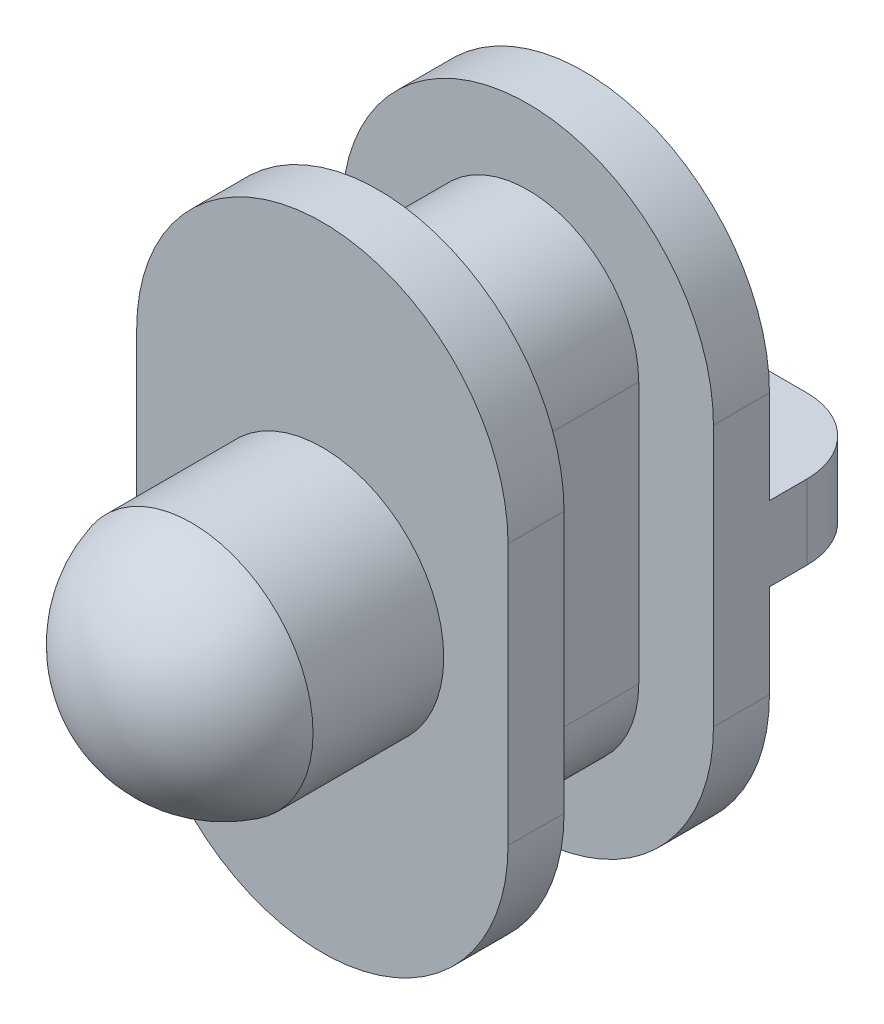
ISO-10303-21;
HEADER;
FILE_DESCRIPTION(('STEP AP214'),'2;1');
FILE_NAME('part.step','',(''),(''),'','','');
FILE_SCHEMA(('AUTOMOTIVE_DESIGN { 1 0 10303 214 1 1 1 1 }'));
ENDSEC;
DATA;
#1=APPLICATION_CONTEXT('core data for automotive mechanical design processes');
#2=APPLICATION_PROTOCOL_DEFINITION('international standard','automotive_design',2000,#1);
#3=PRODUCT_CONTEXT('',#1,'mechanical');
#4=PRODUCT('Part','Part','',(#3));
#5=PRODUCT_RELATED_PRODUCT_CATEGORY('part','',(#4));
#6=PRODUCT_DEFINITION_FORMATION('','',#4);
#7=PRODUCT_DEFINITION_CONTEXT('part definition',#1,'design');
#8=PRODUCT_DEFINITION('design','',#6,#7);
#9=PRODUCT_DEFINITION_SHAPE('','',#8);
#10=(LENGTH_UNIT() NAMED_UNIT(*) SI_UNIT(.MILLI.,.METRE.));
#11=(NAMED_UNIT(*) PLANE_ANGLE_UNIT() SI_UNIT($,.RADIAN.));
#12=(NAMED_UNIT(*) SI_UNIT($,.STERADIAN.) SOLID_ANGLE_UNIT());
#13=UNCERTAINTY_MEASURE_WITH_UNIT(LENGTH_MEASURE(1.E-05),#10,'distance_accuracy_value','');
#14=(GEOMETRIC_REPRESENTATION_CONTEXT(3) GLOBAL_UNCERTAINTY_ASSIGNED_CONTEXT((#13)) GLOBAL_UNIT_ASSIGNED_CONTEXT((#10,
#11,#12)) REPRESENTATION_CONTEXT('',''));
#15=CARTESIAN_POINT('',(0.,0.,0.));
#16=DIRECTION('',(0.,0.,1.));
#17=DIRECTION('',(1.,0.,0.));
#18=AXIS2_PLACEMENT_3D('',#15,#16,#17);
#19=CARTESIAN_POINT('',(2.97174892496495,9.42049986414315,-1.5));
#20=DIRECTION('',(0.,0.,-1.));
#21=DIRECTION('',(1.,0.,0.));
#22=AXIS2_PLACEMENT_3D('',#19,#20,#21);
#23=PLANE('',#22);
#24=DIRECTION('',(-1.,0.,0.));
#25=VECTOR('',#24,1.);
#26=CARTESIAN_POINT('',(7.94349784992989,4.92049986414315,-1.5));
#27=LINE('',#26,#25);
#28=CARTESIAN_POINT('',(7.94349784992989,4.92049986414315,-1.5));
#29=VERTEX_POINT('',#28);
#30=CARTESIAN_POINT('',(-2.,4.92049986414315,-1.5));
#31=VERTEX_POINT('',#30);
#32=EDGE_CURVE('E176',#29,#31,#27,.T.);
#33=ORIENTED_EDGE('',*,*,#32,.F.);
#34=DIRECTION('',(0.,1.,0.));
#35=VECTOR('',#34,1.);
#36=CARTESIAN_POINT('',(7.94349784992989,2.42049986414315,-1.5));
#37=LINE('',#36,#35);
#38=CARTESIAN_POINT('',(7.94349784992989,2.42049986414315,-1.5));
#39=VERTEX_POINT('',#38);
#40=EDGE_CURVE('E172',#39,#29,#37,.T.);
#41=ORIENTED_EDGE('',*,*,#40,.F.);
#42=CARTESIAN_POINT('',(2.97174892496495,2.42049986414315,-1.5));
#43=DIRECTION('',(0.,0.,1.));
#44=DIRECTION('',(1.,0.,0.));
#45=AXIS2_PLACEMENT_3D('',#42,#43,#44);
#46=CIRCLE('',#45,4.97174892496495);
#47=CARTESIAN_POINT('',(-2.,2.42049986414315,-1.5));
#48=VERTEX_POINT('',#47);
#49=EDGE_CURVE('E251',#48,#39,#46,.T.);
#50=ORIENTED_EDGE('',*,*,#49,.F.);
#51=DIRECTION('',(0.,-1.,0.));
#52=VECTOR('',#51,1.);
#53=CARTESIAN_POINT('',(-2.,9.42049986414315,-1.5));
#54=LINE('',#53,#52);
#55=EDGE_CURVE('E184',#31,#48,#54,.T.);
#56=ORIENTED_EDGE('',*,*,#55,.F.);
#57=EDGE_LOOP('',(#33,#41,#50,#56));
#58=FACE_BOUND('',#57,.T.);
#59=ADVANCED_FACE('F27',(#58),#23,.T.);
#60=CARTESIAN_POINT('',(2.97174892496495,9.42049986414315,5.5));
#61=DIRECTION('',(0.,0.,1.));
#62=DIRECTION('',(1.,0.,0.));
#63=AXIS2_PLACEMENT_3D('',#60,#61,#62);
#64=PLANE('',#63);
#65=CARTESIAN_POINT('',(2.97174892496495,9.42049986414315,5.5));
#66=DIRECTION('',(0.,0.,1.));
#67=DIRECTION('',(1.,0.,0.));
#68=AXIS2_PLACEMENT_3D('',#65,#66,#67);
#69=CIRCLE('',#68,4.97174892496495);
#70=CARTESIAN_POINT('',(7.94349784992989,9.42049986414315,5.5));
#71=VERTEX_POINT('',#70);
#72=CARTESIAN_POINT('',(-2.,9.42049986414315,5.5));
#73=VERTEX_POINT('',#72);
#74=EDGE_CURVE('E309',#71,#73,#69,.T.);
#75=ORIENTED_EDGE('',*,*,#74,.T.);
#76=DIRECTION('',(0.,-1.,0.));
#77=VECTOR('',#76,1.);
#78=CARTESIAN_POINT('',(-2.,9.42049986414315,5.5));
#79=LINE('',#78,#77);
#80=CARTESIAN_POINT('',(-2.,2.42049986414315,5.5));
#81=VERTEX_POINT('',#80);
#82=EDGE_CURVE('E307',#73,#81,#79,.T.);
#83=ORIENTED_EDGE('',*,*,#82,.T.);
#84=CARTESIAN_POINT('',(2.97174892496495,2.42049986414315,5.5));
#85=DIRECTION('',(0.,0.,1.));
#86=DIRECTION('',(1.,0.,0.));
#87=AXIS2_PLACEMENT_3D('',#84,#85,#86);
#88=CIRCLE('',#87,4.97174892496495);
#89=CARTESIAN_POINT('',(7.94349784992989,2.42049986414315,5.5));
#90=VERTEX_POINT('',#89);
#91=EDGE_CURVE('E305',#81,#90,#88,.T.);
#92=ORIENTED_EDGE('',*,*,#91,.T.);
#93=DIRECTION('',(0.,1.,0.));
#94=VECTOR('',#93,1.);
#95=CARTESIAN_POINT('',(7.94349784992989,2.42049986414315,5.5));
#96=LINE('',#95,#94);
#97=EDGE_CURVE('E303',#90,#71,#96,.T.);
#98=ORIENTED_EDGE('',*,*,#97,.T.);
#99=EDGE_LOOP('',(#75,#83,#92,#98));
#100=FACE_BOUND('',#99,.T.);
#101=CARTESIAN_POINT('',(2.97174892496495,5.92049986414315,5.5));
#102=DIRECTION('',(0.,0.,1.));
#103=DIRECTION('',(1.,0.,0.));
#104=AXIS2_PLACEMENT_3D('',#101,#102,#103);
#105=CIRCLE('',#104,3.25);
#106=CARTESIAN_POINT('',(6.22174892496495,5.92049986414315,5.5));
#107=VERTEX_POINT('',#106);
#108=EDGE_CURVE('E227',#107,#107,#105,.T.);
#109=ORIENTED_EDGE('',*,*,#108,.F.);
#110=EDGE_LOOP('',(#109));
#111=FACE_BOUND('',#110,.T.);
#112=ADVANCED_FACE('F362',(#100,#111),#64,.T.);
#113=CARTESIAN_POINT('',(2.97174892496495,9.42049986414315,4.));
#114=DIRECTION('',(0.,0.,-1.));
#115=DIRECTION('',(-1.,0.,0.));
#116=AXIS2_PLACEMENT_3D('',#113,#114,#115);
#117=CYLINDRICAL_SURFACE('',#116,2.97174892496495);
#118=CARTESIAN_POINT('',(2.97174892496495,9.42049986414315,0.));
#119=DIRECTION('',(0.,0.,1.));
#120=DIRECTION('',(-1.,0.,0.));
#121=AXIS2_PLACEMENT_3D('',#118,#119,#120);
#122=CIRCLE('',#121,2.97174892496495);
#123=CARTESIAN_POINT('',(5.94349784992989,9.42049986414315,0.));
#124=VERTEX_POINT('',#123);
#125=CARTESIAN_POINT('',(0.,9.42049986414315,0.));
#126=VERTEX_POINT('',#125);
#127=EDGE_CURVE('E288',#124,#126,#122,.T.);
#128=ORIENTED_EDGE('',*,*,#127,.T.);
#129=DIRECTION('',(0.,0.,-1.));
#130=VECTOR('',#129,1.);
#131=CARTESIAN_POINT('',(0.,9.42049986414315,4.));
#132=LINE('',#131,#130);
#133=CARTESIAN_POINT('',(0.,9.42049986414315,4.));
#134=VERTEX_POINT('',#133);
#135=EDGE_CURVE('E225',#134,#126,#132,.T.);
#136=ORIENTED_EDGE('',*,*,#135,.F.);
#137=CARTESIAN_POINT('',(2.97174892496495,9.42049986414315,4.));
#138=DIRECTION('',(0.,0.,1.));
#139=DIRECTION('',(-1.,0.,0.));
#140=AXIS2_PLACEMENT_3D('',#137,#138,#139);
#141=CIRCLE('',#140,2.97174892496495);
#142=CARTESIAN_POINT('',(5.94349784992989,9.42049986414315,4.));
#143=VERTEX_POINT('',#142);
#144=EDGE_CURVE('E276',#143,#134,#141,.T.);
#145=ORIENTED_EDGE('',*,*,#144,.F.);
#146=DIRECTION('',(0.,0.,-1.));
#147=VECTOR('',#146,1.);
#148=CARTESIAN_POINT('',(5.94349784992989,9.42049986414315,4.));
#149=LINE('',#148,#147);
#150=EDGE_CURVE('E264',#143,#124,#149,.T.);
#151=ORIENTED_EDGE('',*,*,#150,.T.);
#152=EDGE_LOOP('',(#128,#136,#145,#151));
#153=FACE_BOUND('',#152,.T.);
#154=ADVANCED_FACE('F369',(#153),#117,.T.);
#155=CARTESIAN_POINT('',(0.,2.42049986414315,4.));
#156=DIRECTION('',(1.,0.,0.));
#157=DIRECTION('',(0.,0.,-1.));
#158=AXIS2_PLACEMENT_3D('',#155,#156,#157);
#159=PLANE('',#158);
#160=DIRECTION('',(0.,-1.,0.));
#161=VECTOR('',#160,1.);
#162=CARTESIAN_POINT('',(0.,2.42049986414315,0.));
#163=LINE('',#162,#161);
#164=CARTESIAN_POINT('',(0.,2.42049986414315,0.));
#165=VERTEX_POINT('',#164);
#166=EDGE_CURVE('E285',#126,#165,#163,.T.);
#167=ORIENTED_EDGE('',*,*,#166,.T.);
#168=DIRECTION('',(0.,0.,-1.));
#169=VECTOR('',#168,1.);
#170=CARTESIAN_POINT('',(0.,2.42049986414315,4.));
#171=LINE('',#170,#169);
#172=CARTESIAN_POINT('',(0.,2.42049986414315,4.));
#173=VERTEX_POINT('',#172);
#174=EDGE_CURVE('E258',#173,#165,#171,.T.);
#175=ORIENTED_EDGE('',*,*,#174,.F.);
#176=DIRECTION('',(0.,-1.,0.));
#177=VECTOR('',#176,1.);
#178=CARTESIAN_POINT('',(0.,2.42049986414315,4.));
#179=LINE('',#178,#177);
#180=EDGE_CURVE('E273',#134,#173,#179,.T.);
#181=ORIENTED_EDGE('',*,*,#180,.F.);
#182=ORIENTED_EDGE('',*,*,#135,.T.);
#183=EDGE_LOOP('',(#167,#175,#181,#182));
#184=FACE_BOUND('',#183,.T.);
#185=ADVANCED_FACE('F507',(#184),#159,.F.);
#186=CARTESIAN_POINT('',(2.97174892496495,2.42049986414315,4.));
#187=DIRECTION('',(0.,0.,-1.));
#188=DIRECTION('',(-1.,0.,0.));
#189=AXIS2_PLACEMENT_3D('',#186,#187,#188);
#190=CYLINDRICAL_SURFACE('',#189,2.97174892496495);
#191=CARTESIAN_POINT('',(2.97174892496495,2.42049986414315,0.));
#192=DIRECTION('',(0.,0.,1.));
#193=DIRECTION('',(1.,0.,0.));
#194=AXIS2_PLACEMENT_3D('',#191,#192,#193);
#195=CIRCLE('',#194,2.97174892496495);
#196=CARTESIAN_POINT('',(5.94349784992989,2.42049986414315,0.));
#197=VERTEX_POINT('',#196);
#198=EDGE_CURVE('E282',#165,#197,#195,.T.);
#199=ORIENTED_EDGE('',*,*,#198,.T.);
#200=DIRECTION('',(0.,0.,-1.));
#201=VECTOR('',#200,1.);
#202=CARTESIAN_POINT('',(5.94349784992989,2.42049986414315,4.));
#203=LINE('',#202,#201);
#204=CARTESIAN_POINT('',(5.94349784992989,2.42049986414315,4.));
#205=VERTEX_POINT('',#204);
#206=EDGE_CURVE('E261',#205,#197,#203,.T.);
#207=ORIENTED_EDGE('',*,*,#206,.F.);
#208=CARTESIAN_POINT('',(2.97174892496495,2.42049986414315,4.));
#209=DIRECTION('',(0.,0.,1.));
#210=DIRECTION('',(1.,0.,0.));
#211=AXIS2_PLACEMENT_3D('',#208,#209,#210);
#212=CIRCLE('',#211,2.97174892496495);
#213=EDGE_CURVE('E270',#173,#205,#212,.T.);
#214=ORIENTED_EDGE('',*,*,#213,.F.);
#215=ORIENTED_EDGE('',*,*,#174,.T.);
#216=EDGE_LOOP('',(#199,#207,#214,#215));
#217=FACE_BOUND('',#216,.T.);
#218=ADVANCED_FACE('F499',(#217),#190,.T.);
#219=CARTESIAN_POINT('',(5.94349784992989,2.42049986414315,4.));
#220=DIRECTION('',(-1.,0.,0.));
#221=DIRECTION('',(0.,-1.,0.));
#222=AXIS2_PLACEMENT_3D('',#219,#220,#221);
#223=PLANE('',#222);
#224=DIRECTION('',(0.,1.,0.));
#225=VECTOR('',#224,1.);
#226=CARTESIAN_POINT('',(5.94349784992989,2.42049986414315,0.));
#227=LINE('',#226,#225);
#228=EDGE_CURVE('E279',#197,#124,#227,.T.);
#229=ORIENTED_EDGE('',*,*,#228,.T.);
#230=ORIENTED_EDGE('',*,*,#150,.F.);
#231=DIRECTION('',(0.,1.,0.));
#232=VECTOR('',#231,1.);
#233=CARTESIAN_POINT('',(5.94349784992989,2.42049986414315,4.));
#234=LINE('',#233,#232);
#235=EDGE_CURVE('E267',#205,#143,#234,.T.);
#236=ORIENTED_EDGE('',*,*,#235,.F.);
#237=ORIENTED_EDGE('',*,*,#206,.T.);
#238=EDGE_LOOP('',(#229,#230,#236,#237));
#239=FACE_BOUND('',#238,.T.);
#240=ADVANCED_FACE('F493',(#239),#223,.F.);
#241=CARTESIAN_POINT('',(2.97174892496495,9.42049986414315,4.));
#242=DIRECTION('',(0.,0.,1.));
#243=DIRECTION('',(1.,0.,0.));
#244=AXIS2_PLACEMENT_3D('',#241,#242,#243);
#245=PLANE('',#244);
#246=CARTESIAN_POINT('',(2.97174892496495,9.42049986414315,4.));
#247=DIRECTION('',(0.,0.,1.));
#248=DIRECTION('',(1.,0.,0.));
#249=AXIS2_PLACEMENT_3D('',#246,#247,#248);
#250=CIRCLE('',#249,4.97174892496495);
#251=CARTESIAN_POINT('',(7.94349784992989,9.42049986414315,4.));
#252=VERTEX_POINT('',#251);
#253=CARTESIAN_POINT('',(-2.,9.42049986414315,4.));
#254=VERTEX_POINT('',#253);
#255=EDGE_CURVE('E318',#252,#254,#250,.T.);
#256=ORIENTED_EDGE('',*,*,#255,.F.);
#257=DIRECTION('',(0.,1.,0.));
#258=VECTOR('',#257,1.);
#259=CARTESIAN_POINT('',(7.94349784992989,2.42049986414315,4.));
#260=LINE('',#259,#258);
#261=CARTESIAN_POINT('',(7.94349784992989,2.42049986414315,4.));
#262=VERTEX_POINT('',#261);
#263=EDGE_CURVE('E312',#262,#252,#260,.T.);
#264=ORIENTED_EDGE('',*,*,#263,.F.);
#265=CARTESIAN_POINT('',(2.97174892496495,2.42049986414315,4.));
#266=DIRECTION('',(0.,0.,1.));
#267=DIRECTION('',(1.,0.,0.));
#268=AXIS2_PLACEMENT_3D('',#265,#266,#267);
#269=CIRCLE('',#268,4.97174892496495);
#270=CARTESIAN_POINT('',(-2.,2.42049986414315,4.));
#271=VERTEX_POINT('',#270);
#272=EDGE_CURVE('E314',#271,#262,#269,.T.);
#273=ORIENTED_EDGE('',*,*,#272,.F.);
#274=DIRECTION('',(0.,-1.,0.));
#275=VECTOR('',#274,1.);
#276=CARTESIAN_POINT('',(-2.,9.42049986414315,4.));
#277=LINE('',#276,#275);
#278=EDGE_CURVE('E316',#254,#271,#277,.T.);
#279=ORIENTED_EDGE('',*,*,#278,.F.);
#280=EDGE_LOOP('',(#256,#264,#273,#279));
#281=FACE_BOUND('',#280,.T.);
#282=ORIENTED_EDGE('',*,*,#235,.T.);
#283=ORIENTED_EDGE('',*,*,#144,.T.);
#284=ORIENTED_EDGE('',*,*,#180,.T.);
#285=ORIENTED_EDGE('',*,*,#213,.T.);
#286=EDGE_LOOP('',(#282,#283,#284,#285));
#287=FACE_BOUND('',#286,.T.);
#288=ADVANCED_FACE('F485',(#281,#287),#245,.F.);
#289=CARTESIAN_POINT('',(2.97174892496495,9.42049986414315,5.5));
#290=DIRECTION('',(0.,0.,-1.));
#291=DIRECTION('',(-1.,0.,0.));
#292=AXIS2_PLACEMENT_3D('',#289,#290,#291);
#293=CYLINDRICAL_SURFACE('',#292,4.97174892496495);
#294=ORIENTED_EDGE('',*,*,#255,.T.);
#295=DIRECTION('',(0.,0.,-1.));
#296=VECTOR('',#295,1.);
#297=CARTESIAN_POINT('',(-2.,9.42049986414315,5.5));
#298=LINE('',#297,#296);
#299=EDGE_CURVE('E291',#73,#254,#298,.T.);
#300=ORIENTED_EDGE('',*,*,#299,.F.);
#301=ORIENTED_EDGE('',*,*,#74,.F.);
#302=DIRECTION('',(0.,0.,-1.));
#303=VECTOR('',#302,1.);
#304=CARTESIAN_POINT('',(7.94349784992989,9.42049986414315,5.5));
#305=LINE('',#304,#303);
#306=EDGE_CURVE('E300',#71,#252,#305,.T.);
#307=ORIENTED_EDGE('',*,*,#306,.T.);
#308=EDGE_LOOP('',(#294,#300,#301,#307));
#309=FACE_BOUND('',#308,.T.);
#310=ADVANCED_FACE('F477',(#309),#293,.T.);
#311=CARTESIAN_POINT('',(-2.,9.42049986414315,5.5));
#312=DIRECTION('',(1.,0.,0.));
#313=DIRECTION('',(0.,0.,-1.));
#314=AXIS2_PLACEMENT_3D('',#311,#312,#313);
#315=PLANE('',#314);
#316=ORIENTED_EDGE('',*,*,#278,.T.);
#317=DIRECTION('',(0.,0.,-1.));
#318=VECTOR('',#317,1.);
#319=CARTESIAN_POINT('',(-2.,2.42049986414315,5.5));
#320=LINE('',#319,#318);
#321=EDGE_CURVE('E294',#81,#271,#320,.T.);
#322=ORIENTED_EDGE('',*,*,#321,.F.);
#323=ORIENTED_EDGE('',*,*,#82,.F.);
#324=ORIENTED_EDGE('',*,*,#299,.T.);
#325=EDGE_LOOP('',(#316,#322,#323,#324));
#326=FACE_BOUND('',#325,.T.);
#327=ADVANCED_FACE('F469',(#326),#315,.F.);
#328=CARTESIAN_POINT('',(2.97174892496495,2.42049986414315,5.5));
#329=DIRECTION('',(0.,0.,-1.));
#330=DIRECTION('',(-1.,0.,0.));
#331=AXIS2_PLACEMENT_3D('',#328,#329,#330);
#332=CYLINDRICAL_SURFACE('',#331,4.97174892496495);
#333=ORIENTED_EDGE('',*,*,#272,.T.);
#334=DIRECTION('',(0.,0.,-1.));
#335=VECTOR('',#334,1.);
#336=CARTESIAN_POINT('',(7.94349784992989,2.42049986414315,5.5));
#337=LINE('',#336,#335);
#338=EDGE_CURVE('E297',#90,#262,#337,.T.);
#339=ORIENTED_EDGE('',*,*,#338,.F.);
#340=ORIENTED_EDGE('',*,*,#91,.F.);
#341=ORIENTED_EDGE('',*,*,#321,.T.);
#342=EDGE_LOOP('',(#333,#339,#340,#341));
#343=FACE_BOUND('',#342,.T.);
#344=ADVANCED_FACE('F460',(#343),#332,.T.);
#345=CARTESIAN_POINT('',(7.94349784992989,2.42049986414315,5.5));
#346=DIRECTION('',(-1.,0.,0.));
#347=DIRECTION('',(0.,-1.,0.));
#348=AXIS2_PLACEMENT_3D('',#345,#346,#347);
#349=PLANE('',#348);
#350=ORIENTED_EDGE('',*,*,#263,.T.);
#351=ORIENTED_EDGE('',*,*,#306,.F.);
#352=ORIENTED_EDGE('',*,*,#97,.F.);
#353=ORIENTED_EDGE('',*,*,#338,.T.);
#354=EDGE_LOOP('',(#350,#351,#352,#353));
#355=FACE_BOUND('',#354,.T.);
#356=ADVANCED_FACE('F358',(#355),#349,.F.);
#357=CARTESIAN_POINT('',(2.97174892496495,9.42049986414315,0.));
#358=DIRECTION('',(0.,0.,-1.));
#359=DIRECTION('',(1.,0.,0.));
#360=AXIS2_PLACEMENT_3D('',#357,#358,#359);
#361=PLANE('',#360);
#362=CARTESIAN_POINT('',(2.97174892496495,9.42049986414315,0.));
#363=DIRECTION('',(0.,0.,1.));
#364=DIRECTION('',(1.,0.,0.));
#365=AXIS2_PLACEMENT_3D('',#362,#363,#364);
#366=CIRCLE('',#365,4.97174892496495);
#367=CARTESIAN_POINT('',(7.94349784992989,9.42049986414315,0.));
#368=VERTEX_POINT('',#367);
#369=CARTESIAN_POINT('',(-2.,9.42049986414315,0.));
#370=VERTEX_POINT('',#369);
#371=EDGE_CURVE('E234',#368,#370,#366,.T.);
#372=ORIENTED_EDGE('',*,*,#371,.T.);
#373=DIRECTION('',(0.,-1.,0.));
#374=VECTOR('',#373,1.);
#375=CARTESIAN_POINT('',(-2.,9.42049986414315,0.));
#376=LINE('',#375,#374);
#377=CARTESIAN_POINT('',(-2.,2.42049986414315,0.));
#378=VERTEX_POINT('',#377);
#379=EDGE_CURVE('E245',#370,#378,#376,.T.);
#380=ORIENTED_EDGE('',*,*,#379,.T.);
#381=CARTESIAN_POINT('',(2.97174892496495,2.42049986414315,0.));
#382=DIRECTION('',(0.,0.,1.));
#383=DIRECTION('',(1.,0.,0.));
#384=AXIS2_PLACEMENT_3D('',#381,#382,#383);
#385=CIRCLE('',#384,4.97174892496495);
#386=CARTESIAN_POINT('',(7.94349784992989,2.42049986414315,0.));
#387=VERTEX_POINT('',#386);
#388=EDGE_CURVE('E242',#378,#387,#385,.T.);
#389=ORIENTED_EDGE('',*,*,#388,.T.);
#390=DIRECTION('',(0.,1.,0.));
#391=VECTOR('',#390,1.);
#392=CARTESIAN_POINT('',(7.94349784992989,2.42049986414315,0.));
#393=LINE('',#392,#391);
#394=EDGE_CURVE('E239',#387,#368,#393,.T.);
#395=ORIENTED_EDGE('',*,*,#394,.T.);
#396=EDGE_LOOP('',(#372,#380,#389,#395));
#397=FACE_BOUND('',#396,.T.);
#398=ORIENTED_EDGE('',*,*,#166,.F.);
#399=ORIENTED_EDGE('',*,*,#127,.F.);
#400=ORIENTED_EDGE('',*,*,#228,.F.);
#401=ORIENTED_EDGE('',*,*,#198,.F.);
#402=EDGE_LOOP('',(#398,#399,#400,#401));
#403=FACE_BOUND('',#402,.T.);
#404=ADVANCED_FACE('F344',(#397,#403),#361,.F.);
#405=CARTESIAN_POINT('',(2.97174892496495,9.42049986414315,-1.5));
#406=DIRECTION('',(0.,0.,1.));
#407=DIRECTION('',(1.,0.,0.));
#408=AXIS2_PLACEMENT_3D('',#405,#406,#407);
#409=CYLINDRICAL_SURFACE('',#408,4.97174892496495);
#410=ORIENTED_EDGE('',*,*,#371,.F.);
#411=DIRECTION('',(0.,0.,1.));
#412=VECTOR('',#411,1.);
#413=CARTESIAN_POINT('',(7.94349784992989,9.42049986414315,-1.5));
#414=LINE('',#413,#412);
#415=CARTESIAN_POINT('',(7.94349784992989,9.42049986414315,-1.5));
#416=VERTEX_POINT('',#415);
#417=EDGE_CURVE('E321',#416,#368,#414,.T.);
#418=ORIENTED_EDGE('',*,*,#417,.F.);
#419=CARTESIAN_POINT('',(2.97174892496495,9.42049986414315,-1.5));
#420=DIRECTION('',(0.,0.,1.));
#421=DIRECTION('',(1.,0.,0.));
#422=AXIS2_PLACEMENT_3D('',#419,#420,#421);
#423=CIRCLE('',#422,4.97174892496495);
#424=CARTESIAN_POINT('',(-2.,9.42049986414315,-1.5));
#425=VERTEX_POINT('',#424);
#426=EDGE_CURVE('E171',#416,#425,#423,.T.);
#427=ORIENTED_EDGE('',*,*,#426,.T.);
#428=DIRECTION('',(0.,0.,1.));
#429=VECTOR('',#428,1.);
#430=CARTESIAN_POINT('',(-2.,9.42049986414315,-1.5));
#431=LINE('',#430,#429);
#432=EDGE_CURVE('E327',#425,#370,#431,.T.);
#433=ORIENTED_EDGE('',*,*,#432,.T.);
#434=EDGE_LOOP('',(#410,#418,#427,#433));
#435=FACE_BOUND('',#434,.T.);
#436=ADVANCED_FACE('F349',(#435),#409,.T.);
#437=CARTESIAN_POINT('',(7.94349784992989,2.42049986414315,-1.5));
#438=DIRECTION('',(1.,0.,0.));
#439=DIRECTION('',(0.,1.,0.));
#440=AXIS2_PLACEMENT_3D('',#437,#438,#439);
#441=PLANE('',#440);
#442=DIRECTION('',(0.,0.,1.));
#443=VECTOR('',#442,1.);
#444=CARTESIAN_POINT('',(7.94349784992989,4.92049986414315,-4.5));
#445=LINE('',#444,#443);
#446=CARTESIAN_POINT('',(7.94349784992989,4.92049986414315,-2.5));
#447=VERTEX_POINT('',#446);
#448=EDGE_CURVE('E161',#447,#29,#445,.T.);
#449=ORIENTED_EDGE('',*,*,#448,.F.);
#450=DIRECTION('',(0.,-1.,0.));
#451=VECTOR('',#450,1.);
#452=CARTESIAN_POINT('',(7.94349784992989,2.42049986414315,-2.5));
#453=LINE('',#452,#451);
#454=CARTESIAN_POINT('',(7.94349784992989,6.92049986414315,-2.5));
#455=VERTEX_POINT('',#454);
#456=EDGE_CURVE('E11',#447,#455,#453,.F.);
#457=ORIENTED_EDGE('',*,*,#456,.T.);
#458=DIRECTION('',(0.,0.,1.));
#459=VECTOR('',#458,1.);
#460=CARTESIAN_POINT('',(7.94349784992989,6.92049986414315,-4.5));
#461=LINE('',#460,#459);
#462=CARTESIAN_POINT('',(7.94349784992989,6.92049986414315,-1.5));
#463=VERTEX_POINT('',#462);
#464=EDGE_CURVE('E151',#455,#463,#461,.T.);
#465=ORIENTED_EDGE('',*,*,#464,.T.);
#466=EDGE_CURVE('E154',#463,#416,#37,.T.);
#467=ORIENTED_EDGE('',*,*,#466,.T.);
#468=ORIENTED_EDGE('',*,*,#417,.T.);
#469=ORIENTED_EDGE('',*,*,#394,.F.);
#470=DIRECTION('',(0.,0.,1.));
#471=VECTOR('',#470,1.);
#472=CARTESIAN_POINT('',(7.94349784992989,2.42049986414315,-1.5));
#473=LINE('',#472,#471);
#474=EDGE_CURVE('E323',#39,#387,#473,.T.);
#475=ORIENTED_EDGE('',*,*,#474,.F.);
#476=ORIENTED_EDGE('',*,*,#40,.T.);
#477=EDGE_LOOP('',(#449,#457,#465,#467,#468,#469,#475,#476));
#478=FACE_BOUND('',#477,.T.);
#479=ADVANCED_FACE('F153',(#478),#441,.T.);
#480=CARTESIAN_POINT('',(2.97174892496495,2.42049986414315,-1.5));
#481=DIRECTION('',(0.,0.,1.));
#482=DIRECTION('',(1.,0.,0.));
#483=AXIS2_PLACEMENT_3D('',#480,#481,#482);
#484=CYLINDRICAL_SURFACE('',#483,4.97174892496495);
#485=ORIENTED_EDGE('',*,*,#388,.F.);
#486=DIRECTION('',(0.,0.,1.));
#487=VECTOR('',#486,1.);
#488=CARTESIAN_POINT('',(-2.,2.42049986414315,-1.5));
#489=LINE('',#488,#487);
#490=EDGE_CURVE('E325',#48,#378,#489,.T.);
#491=ORIENTED_EDGE('',*,*,#490,.F.);
#492=ORIENTED_EDGE('',*,*,#49,.T.);
#493=ORIENTED_EDGE('',*,*,#474,.T.);
#494=EDGE_LOOP('',(#485,#491,#492,#493));
#495=FACE_BOUND('',#494,.T.);
#496=ADVANCED_FACE('F337',(#495),#484,.T.);
#497=CARTESIAN_POINT('',(-2.,9.42049986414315,-1.5));
#498=DIRECTION('',(-1.,0.,0.));
#499=DIRECTION('',(0.,0.,1.));
#500=AXIS2_PLACEMENT_3D('',#497,#498,#499);
#501=PLANE('',#500);
#502=DIRECTION('',(0.,0.,1.));
#503=VECTOR('',#502,1.);
#504=CARTESIAN_POINT('',(-2.,6.92049986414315,-4.5));
#505=LINE('',#504,#503);
#506=CARTESIAN_POINT('',(-2.,6.92049986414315,-2.5));
#507=VERTEX_POINT('',#506);
#508=CARTESIAN_POINT('',(-2.,6.92049986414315,-1.5));
#509=VERTEX_POINT('',#508);
#510=EDGE_CURVE('E160',#507,#509,#505,.T.);
#511=ORIENTED_EDGE('',*,*,#510,.F.);
#512=DIRECTION('',(0.,1.,0.));
#513=VECTOR('',#512,1.);
#514=CARTESIAN_POINT('',(-2.,9.42049986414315,-2.5));
#515=LINE('',#514,#513);
#516=CARTESIAN_POINT('',(-2.,4.92049986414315,-2.5));
#517=VERTEX_POINT('',#516);
#518=EDGE_CURVE('E50',#507,#517,#515,.F.);
#519=ORIENTED_EDGE('',*,*,#518,.T.);
#520=DIRECTION('',(0.,0.,1.));
#521=VECTOR('',#520,1.);
#522=CARTESIAN_POINT('',(-2.,4.92049986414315,-4.5));
#523=LINE('',#522,#521);
#524=EDGE_CURVE('E201',#517,#31,#523,.T.);
#525=ORIENTED_EDGE('',*,*,#524,.T.);
#526=ORIENTED_EDGE('',*,*,#55,.T.);
#527=ORIENTED_EDGE('',*,*,#490,.T.);
#528=ORIENTED_EDGE('',*,*,#379,.F.);
#529=ORIENTED_EDGE('',*,*,#432,.F.);
#530=EDGE_CURVE('E328',#425,#509,#54,.T.);
#531=ORIENTED_EDGE('',*,*,#530,.T.);
#532=EDGE_LOOP('',(#511,#519,#525,#526,#527,#528,#529,#531));
#533=FACE_BOUND('',#532,.T.);
#534=ADVANCED_FACE('F347',(#533),#501,.T.);
#535=DIRECTION('',(1.,0.,0.));
#536=VECTOR('',#535,1.);
#537=CARTESIAN_POINT('',(7.94349784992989,6.92049986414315,-1.5));
#538=LINE('',#537,#536);
#539=EDGE_CURVE('E168',#509,#463,#538,.T.);
#540=ORIENTED_EDGE('',*,*,#539,.F.);
#541=ORIENTED_EDGE('',*,*,#530,.F.);
#542=ORIENTED_EDGE('',*,*,#426,.F.);
#543=ORIENTED_EDGE('',*,*,#466,.F.);
#544=EDGE_LOOP('',(#540,#541,#542,#543));
#545=FACE_BOUND('',#544,.T.);
#546=ADVANCED_FACE('F166',(#545),#23,.T.);
#547=CARTESIAN_POINT('',(2.97174892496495,5.92049986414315,9.));
#548=DIRECTION('',(0.,0.,-1.));
#549=DIRECTION('',(-1.,0.,0.));
#550=AXIS2_PLACEMENT_3D('',#547,#548,#549);
#551=CYLINDRICAL_SURFACE('',#550,3.25);
#552=CARTESIAN_POINT('',(2.97174892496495,5.92049986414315,9.));
#553=DIRECTION('',(0.,0.,1.));
#554=DIRECTION('',(1.,0.,0.));
#555=AXIS2_PLACEMENT_3D('',#552,#553,#554);
#556=CIRCLE('',#555,3.25);
#557=CARTESIAN_POINT('',(6.22174892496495,5.92049986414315,9.));
#558=VERTEX_POINT('',#557);
#559=EDGE_CURVE('E229',#558,#558,#556,.T.);
#560=ORIENTED_EDGE('',*,*,#559,.F.);
#561=EDGE_LOOP('',(#560));
#562=FACE_BOUND('',#561,.T.);
#563=ORIENTED_EDGE('',*,*,#108,.T.);
#564=EDGE_LOOP('',(#563));
#565=FACE_BOUND('',#564,.T.);
#566=ADVANCED_FACE('F373',(#562,#565),#551,.T.);
#567=CARTESIAN_POINT('',(2.97174892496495,5.92049986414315,8.1375));
#568=DIRECTION('',(0.,0.,1.));
#569=DIRECTION('',(1.,0.,0.));
#570=AXIS2_PLACEMENT_3D('',#567,#568,#569);
#571=SPHERICAL_SURFACE('',#570,3.3625);
#572=ORIENTED_EDGE('',*,*,#559,.T.);
#573=EDGE_LOOP('',(#572));
#574=FACE_BOUND('',#573,.T.);
#575=ADVANCED_FACE('F29',(#574),#571,.T.);
#576=CARTESIAN_POINT('',(7.94349784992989,6.92049986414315,-4.5));
#577=DIRECTION('',(0.,-1.,0.));
#578=DIRECTION('',(0.,0.,-1.));
#579=AXIS2_PLACEMENT_3D('',#576,#577,#578);
#580=PLANE('',#579);
#581=DIRECTION('',(1.,0.,0.));
#582=VECTOR('',#581,1.);
#583=CARTESIAN_POINT('',(7.94349784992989,6.92049986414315,-4.5));
#584=LINE('',#583,#582);
#585=CARTESIAN_POINT('',(0.,6.92049986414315,-4.5));
#586=VERTEX_POINT('',#585);
#587=CARTESIAN_POINT('',(5.94349784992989,6.92049986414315,-4.5));
#588=VERTEX_POINT('',#587);
#589=EDGE_CURVE('E179',#586,#588,#584,.T.);
#590=ORIENTED_EDGE('',*,*,#589,.F.);
#591=CARTESIAN_POINT('',(0.,6.92049986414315,-2.5));
#592=DIRECTION('',(0.,-1.,0.));
#593=DIRECTION('',(0.,0.,-1.));
#594=AXIS2_PLACEMENT_3D('',#591,#592,#593);
#595=CIRCLE('',#594,2.);
#596=EDGE_CURVE('E205',#586,#507,#595,.F.);
#597=ORIENTED_EDGE('',*,*,#596,.T.);
#598=ORIENTED_EDGE('',*,*,#510,.T.);
#599=ORIENTED_EDGE('',*,*,#539,.T.);
#600=ORIENTED_EDGE('',*,*,#464,.F.);
#601=CARTESIAN_POINT('',(5.94349784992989,6.92049986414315,-2.5));
#602=DIRECTION('',(0.,-1.,0.));
#603=DIRECTION('',(0.,0.,-1.));
#604=AXIS2_PLACEMENT_3D('',#601,#602,#603);
#605=CIRCLE('',#604,2.);
#606=EDGE_CURVE('E223',#455,#588,#605,.F.);
#607=ORIENTED_EDGE('',*,*,#606,.T.);
#608=EDGE_LOOP('',(#590,#597,#598,#599,#600,#607));
#609=FACE_BOUND('',#608,.T.);
#610=ADVANCED_FACE('F175',(#609),#580,.F.);
#611=CARTESIAN_POINT('',(7.94349784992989,4.92049986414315,-4.5));
#612=DIRECTION('',(0.,1.,0.));
#613=DIRECTION('',(0.,0.,1.));
#614=AXIS2_PLACEMENT_3D('',#611,#612,#613);
#615=PLANE('',#614);
#616=ORIENTED_EDGE('',*,*,#524,.F.);
#617=CARTESIAN_POINT('',(0.,4.92049986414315,-2.5));
#618=DIRECTION('',(0.,1.,0.));
#619=DIRECTION('',(0.,0.,1.));
#620=AXIS2_PLACEMENT_3D('',#617,#618,#619);
#621=CIRCLE('',#620,2.);
#622=CARTESIAN_POINT('',(0.,4.92049986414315,-4.5));
#623=VERTEX_POINT('',#622);
#624=EDGE_CURVE('E35',#517,#623,#621,.F.);
#625=ORIENTED_EDGE('',*,*,#624,.T.);
#626=DIRECTION('',(-1.,0.,0.));
#627=VECTOR('',#626,1.);
#628=CARTESIAN_POINT('',(7.94349784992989,4.92049986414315,-4.5));
#629=LINE('',#628,#627);
#630=CARTESIAN_POINT('',(5.94349784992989,4.92049986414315,-4.5));
#631=VERTEX_POINT('',#630);
#632=EDGE_CURVE('E204',#631,#623,#629,.T.);
#633=ORIENTED_EDGE('',*,*,#632,.F.);
#634=CARTESIAN_POINT('',(5.94349784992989,4.92049986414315,-2.5));
#635=DIRECTION('',(0.,1.,0.));
#636=DIRECTION('',(0.,0.,1.));
#637=AXIS2_PLACEMENT_3D('',#634,#635,#636);
#638=CIRCLE('',#637,2.);
#639=EDGE_CURVE('E42',#631,#447,#638,.F.);
#640=ORIENTED_EDGE('',*,*,#639,.T.);
#641=ORIENTED_EDGE('',*,*,#448,.T.);
#642=ORIENTED_EDGE('',*,*,#32,.T.);
#643=EDGE_LOOP('',(#616,#625,#633,#640,#641,#642));
#644=FACE_BOUND('',#643,.T.);
#645=ADVANCED_FACE('F211',(#644),#615,.F.);
#646=CARTESIAN_POINT('',(-2.,4.92049986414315,-4.5));
#647=DIRECTION('',(0.,0.,-1.));
#648=DIRECTION('',(-1.,0.,0.));
#649=AXIS2_PLACEMENT_3D('',#646,#647,#648);
#650=PLANE('',#649);
#651=ORIENTED_EDGE('',*,*,#632,.T.);
#652=DIRECTION('',(0.,1.,0.));
#653=VECTOR('',#652,1.);
#654=CARTESIAN_POINT('',(0.,4.92049986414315,-4.5));
#655=LINE('',#654,#653);
#656=EDGE_CURVE('E219',#623,#586,#655,.T.);
#657=ORIENTED_EDGE('',*,*,#656,.T.);
#658=ORIENTED_EDGE('',*,*,#589,.T.);
#659=DIRECTION('',(0.,-1.,0.));
#660=VECTOR('',#659,1.);
#661=CARTESIAN_POINT('',(5.94349784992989,4.92049986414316,-4.5));
#662=LINE('',#661,#660);
#663=EDGE_CURVE('E221',#588,#631,#662,.T.);
#664=ORIENTED_EDGE('',*,*,#663,.T.);
#665=EDGE_LOOP('',(#651,#657,#658,#664));
#666=FACE_BOUND('',#665,.T.);
#667=ADVANCED_FACE('F217',(#666),#650,.T.);
#668=CARTESIAN_POINT('',(0.,4.92049986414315,-2.5));
#669=DIRECTION('',(0.,1.,0.));
#670=DIRECTION('',(0.,0.,1.));
#671=AXIS2_PLACEMENT_3D('',#668,#669,#670);
#672=CYLINDRICAL_SURFACE('',#671,2.);
#673=ORIENTED_EDGE('',*,*,#624,.F.);
#674=ORIENTED_EDGE('',*,*,#518,.F.);
#675=ORIENTED_EDGE('',*,*,#596,.F.);
#676=ORIENTED_EDGE('',*,*,#656,.F.);
#677=EDGE_LOOP('',(#673,#674,#675,#676));
#678=FACE_BOUND('',#677,.T.);
#679=ADVANCED_FACE('F222',(#678),#672,.T.);
#680=CARTESIAN_POINT('',(5.94349784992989,4.92049986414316,-2.5));
#681=DIRECTION('',(0.,-1.,0.));
#682=DIRECTION('',(1.,0.,0.));
#683=AXIS2_PLACEMENT_3D('',#680,#681,#682);
#684=CYLINDRICAL_SURFACE('',#683,2.);
#685=ORIENTED_EDGE('',*,*,#606,.F.);
#686=ORIENTED_EDGE('',*,*,#456,.F.);
#687=ORIENTED_EDGE('',*,*,#639,.F.);
#688=ORIENTED_EDGE('',*,*,#663,.F.);
#689=EDGE_LOOP('',(#685,#686,#687,#688));
#690=FACE_BOUND('',#689,.T.);
#691=ADVANCED_FACE('F437',(#690),#684,.T.);
#692=CLOSED_SHELL('',(#59,#112,#154,#185,#218,#240,#288,#310,#327,#344,#356,#404,#436,#479,#496,
#534,#546,#566,#575,#610,#645,#667,#679,#691));
#693=MANIFOLD_SOLID_BREP('B2',#692);
#694=ADVANCED_BREP_SHAPE_REPRESENTATION('',(#18,#693),#14);
#695=SHAPE_DEFINITION_REPRESENTATION(#9,#694);
ENDSEC;
END-ISO-10303-21;
